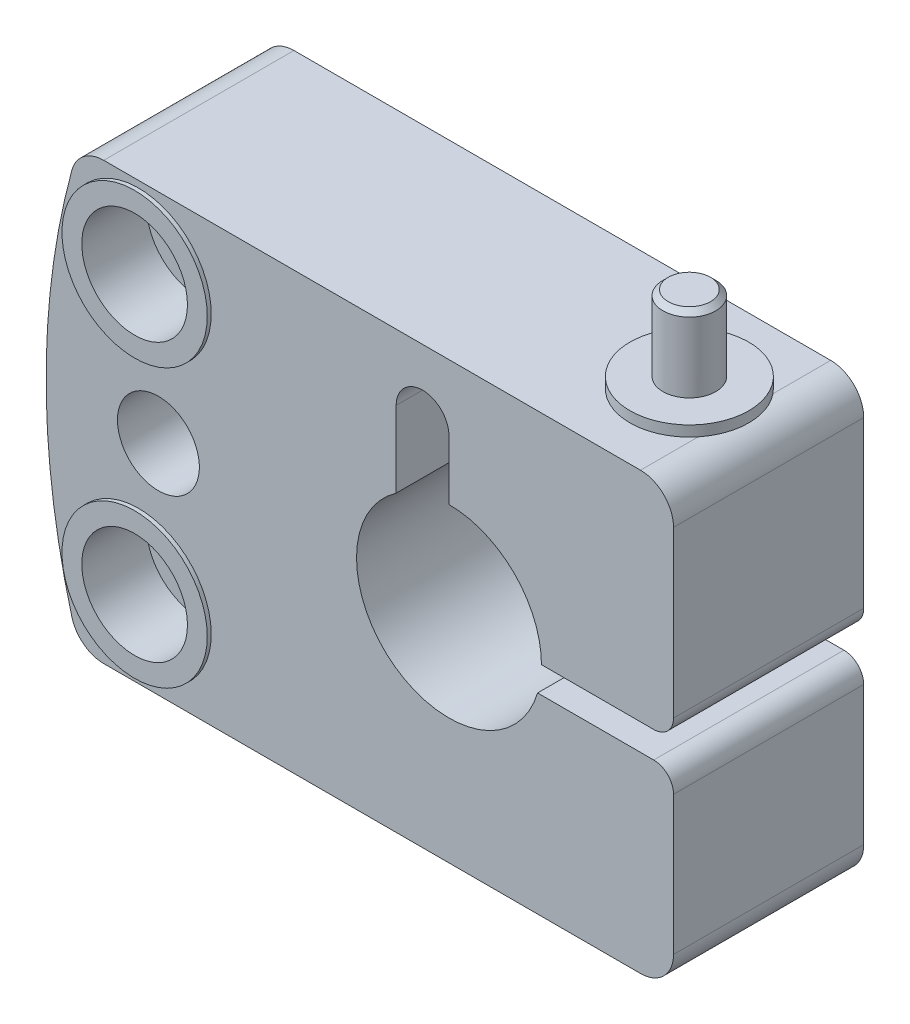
ISO-10303-21;
HEADER;
FILE_DESCRIPTION(('STEP AP214'),'2;1');
FILE_NAME('part.step','',(''),(''),'','','');
FILE_SCHEMA(('AUTOMOTIVE_DESIGN { 1 0 10303 214 1 1 1 1 }'));
ENDSEC;
DATA;
#1=APPLICATION_CONTEXT('core data for automotive mechanical design processes');
#2=APPLICATION_PROTOCOL_DEFINITION('international standard','automotive_design',2000,#1);
#3=PRODUCT_CONTEXT('',#1,'mechanical');
#4=PRODUCT('Part','Part','',(#3));
#5=PRODUCT_RELATED_PRODUCT_CATEGORY('part','',(#4));
#6=PRODUCT_DEFINITION_FORMATION('','',#4);
#7=PRODUCT_DEFINITION_CONTEXT('part definition',#1,'design');
#8=PRODUCT_DEFINITION('design','',#6,#7);
#9=PRODUCT_DEFINITION_SHAPE('','',#8);
#10=(LENGTH_UNIT() NAMED_UNIT(*) SI_UNIT(.MILLI.,.METRE.));
#11=(NAMED_UNIT(*) PLANE_ANGLE_UNIT() SI_UNIT($,.RADIAN.));
#12=(NAMED_UNIT(*) SI_UNIT($,.STERADIAN.) SOLID_ANGLE_UNIT());
#13=UNCERTAINTY_MEASURE_WITH_UNIT(LENGTH_MEASURE(1.E-05),#10,'distance_accuracy_value','');
#14=(GEOMETRIC_REPRESENTATION_CONTEXT(3) GLOBAL_UNCERTAINTY_ASSIGNED_CONTEXT((#13)) GLOBAL_UNIT_ASSIGNED_CONTEXT((#10,
#11,#12)) REPRESENTATION_CONTEXT('',''));
#15=CARTESIAN_POINT('',(0.,0.,0.));
#16=DIRECTION('',(0.,0.,1.));
#17=DIRECTION('',(1.,0.,0.));
#18=AXIS2_PLACEMENT_3D('',#15,#16,#17);
#19=CARTESIAN_POINT('',(-23.5,-10.5,10.1));
#20=DIRECTION('',(0.,0.,-1.));
#21=DIRECTION('',(-1.,0.,0.));
#22=AXIS2_PLACEMENT_3D('',#19,#20,#21);
#23=CYLINDRICAL_SURFACE('',#22,2.25);
#24=CARTESIAN_POINT('',(-23.5,-10.5,4.9));
#25=DIRECTION('',(0.,0.,-1.));
#26=DIRECTION('',(-1.,0.,0.));
#27=AXIS2_PLACEMENT_3D('',#24,#25,#26);
#28=CIRCLE('',#27,2.25);
#29=CARTESIAN_POINT('',(-25.75,-10.5,4.9));
#30=VERTEX_POINT('',#29);
#31=EDGE_CURVE('E334',#30,#30,#28,.F.);
#32=ORIENTED_EDGE('',*,*,#31,.F.);
#33=EDGE_LOOP('',(#32));
#34=FACE_BOUND('',#33,.T.);
#35=CARTESIAN_POINT('',(-23.5,-10.5,10.1));
#36=DIRECTION('',(0.,0.,-1.));
#37=DIRECTION('',(-1.,0.,0.));
#38=AXIS2_PLACEMENT_3D('',#35,#36,#37);
#39=CIRCLE('',#38,2.25);
#40=CARTESIAN_POINT('',(-25.75,-10.5,10.1));
#41=VERTEX_POINT('',#40);
#42=EDGE_CURVE('E339',#41,#41,#39,.T.);
#43=ORIENTED_EDGE('',*,*,#42,.F.);
#44=EDGE_LOOP('',(#43));
#45=FACE_BOUND('',#44,.T.);
#46=ADVANCED_FACE('F16',(#34,#45),#23,.F.);
#47=CARTESIAN_POINT('',(-23.5,10.5,10.1));
#48=DIRECTION('',(0.,0.,-1.));
#49=DIRECTION('',(-1.,0.,0.));
#50=AXIS2_PLACEMENT_3D('',#47,#48,#49);
#51=CYLINDRICAL_SURFACE('',#50,2.25);
#52=CARTESIAN_POINT('',(-23.5,10.5,4.9));
#53=DIRECTION('',(0.,0.,-1.));
#54=DIRECTION('',(-1.,0.,0.));
#55=AXIS2_PLACEMENT_3D('',#52,#53,#54);
#56=CIRCLE('',#55,2.25);
#57=CARTESIAN_POINT('',(-25.75,10.5,4.9));
#58=VERTEX_POINT('',#57);
#59=EDGE_CURVE('E331',#58,#58,#56,.F.);
#60=ORIENTED_EDGE('',*,*,#59,.F.);
#61=EDGE_LOOP('',(#60));
#62=FACE_BOUND('',#61,.T.);
#63=CARTESIAN_POINT('',(-23.5,10.5,10.1));
#64=DIRECTION('',(0.,0.,-1.));
#65=DIRECTION('',(-1.,0.,0.));
#66=AXIS2_PLACEMENT_3D('',#63,#64,#65);
#67=CIRCLE('',#66,2.25);
#68=CARTESIAN_POINT('',(-25.75,10.5,10.1));
#69=VERTEX_POINT('',#68);
#70=EDGE_CURVE('E337',#69,#69,#67,.T.);
#71=ORIENTED_EDGE('',*,*,#70,.F.);
#72=EDGE_LOOP('',(#71));
#73=FACE_BOUND('',#72,.T.);
#74=ADVANCED_FACE('F551',(#62,#73),#51,.F.);
#75=CARTESIAN_POINT('',(-19.452,-14.548,10.1));
#76=DIRECTION('',(0.,0.,1.));
#77=DIRECTION('',(0.,1.,0.));
#78=AXIS2_PLACEMENT_3D('',#75,#76,#77);
#79=PLANE('',#78);
#80=ORIENTED_EDGE('',*,*,#42,.T.);
#81=EDGE_LOOP('',(#80));
#82=FACE_BOUND('',#81,.T.);
#83=CARTESIAN_POINT('',(-23.5,-10.5,10.1));
#84=DIRECTION('',(0.,0.,1.));
#85=DIRECTION('',(1.,0.,0.));
#86=AXIS2_PLACEMENT_3D('',#83,#84,#85);
#87=CIRCLE('',#86,4.);
#88=CARTESIAN_POINT('',(-19.5,-10.5,10.1));
#89=VERTEX_POINT('',#88);
#90=EDGE_CURVE('E328',#89,#89,#87,.F.);
#91=ORIENTED_EDGE('',*,*,#90,.F.);
#92=EDGE_LOOP('',(#91));
#93=FACE_BOUND('',#92,.T.);
#94=ADVANCED_FACE('F554',(#82,#93),#79,.T.);
#95=CARTESIAN_POINT('',(-19.452,6.452,10.1));
#96=DIRECTION('',(0.,0.,1.));
#97=DIRECTION('',(0.,1.,0.));
#98=AXIS2_PLACEMENT_3D('',#95,#96,#97);
#99=PLANE('',#98);
#100=ORIENTED_EDGE('',*,*,#70,.T.);
#101=EDGE_LOOP('',(#100));
#102=FACE_BOUND('',#101,.T.);
#103=CARTESIAN_POINT('',(-23.5,10.5,10.1));
#104=DIRECTION('',(0.,0.,1.));
#105=DIRECTION('',(1.,0.,0.));
#106=AXIS2_PLACEMENT_3D('',#103,#104,#105);
#107=CIRCLE('',#106,4.);
#108=CARTESIAN_POINT('',(-19.5,10.5,10.1));
#109=VERTEX_POINT('',#108);
#110=EDGE_CURVE('E325',#109,#109,#107,.F.);
#111=ORIENTED_EDGE('',*,*,#110,.F.);
#112=EDGE_LOOP('',(#111));
#113=FACE_BOUND('',#112,.T.);
#114=ADVANCED_FACE('F561',(#102,#113),#99,.T.);
#115=CARTESIAN_POINT('',(-19.452,-6.452,4.9));
#116=DIRECTION('',(0.,0.,-1.));
#117=DIRECTION('',(0.,-1.,0.));
#118=AXIS2_PLACEMENT_3D('',#115,#116,#117);
#119=PLANE('',#118);
#120=ORIENTED_EDGE('',*,*,#31,.T.);
#121=EDGE_LOOP('',(#120));
#122=FACE_BOUND('',#121,.T.);
#123=CARTESIAN_POINT('',(-23.5,-10.5,4.9));
#124=DIRECTION('',(0.,0.,-1.));
#125=DIRECTION('',(-1.,0.,0.));
#126=AXIS2_PLACEMENT_3D('',#123,#124,#125);
#127=CIRCLE('',#126,4.);
#128=CARTESIAN_POINT('',(-27.5,-10.5,4.9));
#129=VERTEX_POINT('',#128);
#130=EDGE_CURVE('E322',#129,#129,#127,.F.);
#131=ORIENTED_EDGE('',*,*,#130,.F.);
#132=EDGE_LOOP('',(#131));
#133=FACE_BOUND('',#132,.T.);
#134=ADVANCED_FACE('F564',(#122,#133),#119,.T.);
#135=CARTESIAN_POINT('',(-19.452,14.548,4.9));
#136=DIRECTION('',(0.,0.,-1.));
#137=DIRECTION('',(0.,-1.,0.));
#138=AXIS2_PLACEMENT_3D('',#135,#136,#137);
#139=PLANE('',#138);
#140=ORIENTED_EDGE('',*,*,#59,.T.);
#141=EDGE_LOOP('',(#140));
#142=FACE_BOUND('',#141,.T.);
#143=CARTESIAN_POINT('',(-23.5,10.5,4.9));
#144=DIRECTION('',(0.,0.,-1.));
#145=DIRECTION('',(-1.,0.,0.));
#146=AXIS2_PLACEMENT_3D('',#143,#144,#145);
#147=CIRCLE('',#146,4.);
#148=CARTESIAN_POINT('',(-27.5,10.5,4.9));
#149=VERTEX_POINT('',#148);
#150=EDGE_CURVE('E319',#149,#149,#147,.F.);
#151=ORIENTED_EDGE('',*,*,#150,.F.);
#152=EDGE_LOOP('',(#151));
#153=FACE_BOUND('',#152,.T.);
#154=ADVANCED_FACE('F549',(#142,#153),#139,.T.);
#155=CARTESIAN_POINT('',(-23.5,-10.5,10.1));
#156=DIRECTION('',(0.,0.,1.));
#157=DIRECTION('',(1.,0.,0.));
#158=AXIS2_PLACEMENT_3D('',#155,#156,#157);
#159=CYLINDRICAL_SURFACE('',#158,4.);
#160=CARTESIAN_POINT('',(-23.5,-10.5,15.));
#161=DIRECTION('',(0.,0.,1.));
#162=DIRECTION('',(1.,0.,0.));
#163=AXIS2_PLACEMENT_3D('',#160,#161,#162);
#164=CIRCLE('',#163,4.);
#165=CARTESIAN_POINT('',(-19.5,-10.5,15.));
#166=VERTEX_POINT('',#165);
#167=EDGE_CURVE('E316',#166,#166,#164,.F.);
#168=ORIENTED_EDGE('',*,*,#167,.F.);
#169=EDGE_LOOP('',(#168));
#170=FACE_BOUND('',#169,.T.);
#171=ORIENTED_EDGE('',*,*,#90,.T.);
#172=EDGE_LOOP('',(#171));
#173=FACE_BOUND('',#172,.T.);
#174=ADVANCED_FACE('F545',(#170,#173),#159,.F.);
#175=CARTESIAN_POINT('',(-23.5,10.5,10.1));
#176=DIRECTION('',(0.,0.,1.));
#177=DIRECTION('',(1.,0.,0.));
#178=AXIS2_PLACEMENT_3D('',#175,#176,#177);
#179=CYLINDRICAL_SURFACE('',#178,4.);
#180=CARTESIAN_POINT('',(-23.5,10.5,15.));
#181=DIRECTION('',(0.,0.,1.));
#182=DIRECTION('',(1.,0.,0.));
#183=AXIS2_PLACEMENT_3D('',#180,#181,#182);
#184=CIRCLE('',#183,4.);
#185=CARTESIAN_POINT('',(-19.5,10.5,15.));
#186=VERTEX_POINT('',#185);
#187=EDGE_CURVE('E313',#186,#186,#184,.F.);
#188=ORIENTED_EDGE('',*,*,#187,.F.);
#189=EDGE_LOOP('',(#188));
#190=FACE_BOUND('',#189,.T.);
#191=ORIENTED_EDGE('',*,*,#110,.T.);
#192=EDGE_LOOP('',(#191));
#193=FACE_BOUND('',#192,.T.);
#194=ADVANCED_FACE('F541',(#190,#193),#179,.F.);
#195=CARTESIAN_POINT('',(-23.5,-10.5,4.9));
#196=DIRECTION('',(0.,0.,-1.));
#197=DIRECTION('',(-1.,0.,0.));
#198=AXIS2_PLACEMENT_3D('',#195,#196,#197);
#199=CYLINDRICAL_SURFACE('',#198,4.);
#200=ORIENTED_EDGE('',*,*,#130,.T.);
#201=EDGE_LOOP('',(#200));
#202=FACE_BOUND('',#201,.T.);
#203=CARTESIAN_POINT('',(-23.5,-10.5,0.));
#204=DIRECTION('',(0.,0.,-1.));
#205=DIRECTION('',(-1.,0.,0.));
#206=AXIS2_PLACEMENT_3D('',#203,#204,#205);
#207=CIRCLE('',#206,4.);
#208=CARTESIAN_POINT('',(-27.5,-10.5,0.));
#209=VERTEX_POINT('',#208);
#210=EDGE_CURVE('E310',#209,#209,#207,.T.);
#211=ORIENTED_EDGE('',*,*,#210,.T.);
#212=EDGE_LOOP('',(#211));
#213=FACE_BOUND('',#212,.T.);
#214=ADVANCED_FACE('F537',(#202,#213),#199,.F.);
#215=CARTESIAN_POINT('',(-23.5,10.5,4.9));
#216=DIRECTION('',(0.,0.,-1.));
#217=DIRECTION('',(-1.,0.,0.));
#218=AXIS2_PLACEMENT_3D('',#215,#216,#217);
#219=CYLINDRICAL_SURFACE('',#218,4.);
#220=ORIENTED_EDGE('',*,*,#150,.T.);
#221=EDGE_LOOP('',(#220));
#222=FACE_BOUND('',#221,.T.);
#223=CARTESIAN_POINT('',(-23.5,10.5,0.));
#224=DIRECTION('',(0.,0.,-1.));
#225=DIRECTION('',(-1.,0.,0.));
#226=AXIS2_PLACEMENT_3D('',#223,#224,#225);
#227=CIRCLE('',#226,4.);
#228=CARTESIAN_POINT('',(-27.5,10.5,0.));
#229=VERTEX_POINT('',#228);
#230=EDGE_CURVE('E307',#229,#229,#227,.T.);
#231=ORIENTED_EDGE('',*,*,#230,.T.);
#232=EDGE_LOOP('',(#231));
#233=FACE_BOUND('',#232,.T.);
#234=ADVANCED_FACE('F533',(#222,#233),#219,.F.);
#235=CARTESIAN_POINT('',(-17.934,-16.066,15.));
#236=DIRECTION('',(0.,0.,1.));
#237=DIRECTION('',(0.,1.,0.));
#238=AXIS2_PLACEMENT_3D('',#235,#236,#237);
#239=PLANE('',#238);
#240=ORIENTED_EDGE('',*,*,#167,.T.);
#241=EDGE_LOOP('',(#240));
#242=FACE_BOUND('',#241,.T.);
#243=CARTESIAN_POINT('',(-23.5,-10.5,15.));
#244=DIRECTION('',(0.,0.,1.));
#245=DIRECTION('',(1.,0.,0.));
#246=AXIS2_PLACEMENT_3D('',#243,#244,#245);
#247=CIRCLE('',#246,5.5);
#248=CARTESIAN_POINT('',(-18.,-10.5,15.));
#249=VERTEX_POINT('',#248);
#250=EDGE_CURVE('E304',#249,#249,#247,.T.);
#251=ORIENTED_EDGE('',*,*,#250,.T.);
#252=EDGE_LOOP('',(#251));
#253=FACE_BOUND('',#252,.T.);
#254=ADVANCED_FACE('F536',(#242,#253),#239,.T.);
#255=CARTESIAN_POINT('',(-17.934,4.934,15.));
#256=DIRECTION('',(0.,0.,1.));
#257=DIRECTION('',(0.,1.,0.));
#258=AXIS2_PLACEMENT_3D('',#255,#256,#257);
#259=PLANE('',#258);
#260=ORIENTED_EDGE('',*,*,#187,.T.);
#261=EDGE_LOOP('',(#260));
#262=FACE_BOUND('',#261,.T.);
#263=CARTESIAN_POINT('',(-23.5,10.5,15.));
#264=DIRECTION('',(0.,0.,1.));
#265=DIRECTION('',(1.,0.,0.));
#266=AXIS2_PLACEMENT_3D('',#263,#264,#265);
#267=CIRCLE('',#266,5.5);
#268=CARTESIAN_POINT('',(-18.,10.5,15.));
#269=VERTEX_POINT('',#268);
#270=EDGE_CURVE('E214',#269,#269,#267,.T.);
#271=ORIENTED_EDGE('',*,*,#270,.T.);
#272=EDGE_LOOP('',(#271));
#273=FACE_BOUND('',#272,.T.);
#274=ADVANCED_FACE('F531',(#262,#273),#259,.T.);
#275=CARTESIAN_POINT('',(11.,-2.,7.5));
#276=DIRECTION('',(0.,1.,0.));
#277=DIRECTION('',(0.,0.,1.));
#278=AXIS2_PLACEMENT_3D('',#275,#276,#277);
#279=CYLINDRICAL_SURFACE('',#278,2.);
#280=CARTESIAN_POINT('',(11.,-2.09207651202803E-11,7.5));
#281=DIRECTION('',(0.,1.,0.));
#282=DIRECTION('',(0.,0.,1.));
#283=AXIS2_PLACEMENT_3D('',#280,#281,#282);
#284=CIRCLE('',#283,2.);
#285=CARTESIAN_POINT('',(11.,-2.09207651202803E-11,9.5));
#286=VERTEX_POINT('',#285);
#287=EDGE_CURVE('E187',#286,#286,#284,.F.);
#288=ORIENTED_EDGE('',*,*,#287,.T.);
#289=EDGE_LOOP('',(#288));
#290=FACE_BOUND('',#289,.T.);
#291=CARTESIAN_POINT('',(11.,-1.99999999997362,7.5));
#292=DIRECTION('',(0.,1.,0.));
#293=DIRECTION('',(0.,0.,1.));
#294=AXIS2_PLACEMENT_3D('',#291,#292,#293);
#295=CIRCLE('',#294,2.);
#296=CARTESIAN_POINT('',(11.,-1.99999999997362,9.5));
#297=VERTEX_POINT('',#296);
#298=EDGE_CURVE('E208',#297,#297,#295,.T.);
#299=ORIENTED_EDGE('',*,*,#298,.T.);
#300=EDGE_LOOP('',(#299));
#301=FACE_BOUND('',#300,.T.);
#302=ADVANCED_FACE('F527',(#290,#301),#279,.T.);
#303=CARTESIAN_POINT('',(-17.934,-16.066,0.));
#304=DIRECTION('',(0.,0.,1.));
#305=DIRECTION('',(0.,1.,0.));
#306=AXIS2_PLACEMENT_3D('',#303,#304,#305);
#307=PLANE('',#306);
#308=ORIENTED_EDGE('',*,*,#210,.F.);
#309=EDGE_LOOP('',(#308));
#310=FACE_BOUND('',#309,.T.);
#311=CARTESIAN_POINT('',(-23.5,-10.5,0.));
#312=DIRECTION('',(0.,0.,-1.));
#313=DIRECTION('',(-1.,0.,0.));
#314=AXIS2_PLACEMENT_3D('',#311,#312,#313);
#315=CIRCLE('',#314,5.5);
#316=CARTESIAN_POINT('',(-29.,-10.5,0.));
#317=VERTEX_POINT('',#316);
#318=EDGE_CURVE('E295',#317,#317,#315,.T.);
#319=ORIENTED_EDGE('',*,*,#318,.T.);
#320=EDGE_LOOP('',(#319));
#321=FACE_BOUND('',#320,.T.);
#322=ADVANCED_FACE('F530',(#310,#321),#307,.F.);
#323=CARTESIAN_POINT('',(-17.934,4.934,0.));
#324=DIRECTION('',(0.,0.,1.));
#325=DIRECTION('',(0.,1.,0.));
#326=AXIS2_PLACEMENT_3D('',#323,#324,#325);
#327=PLANE('',#326);
#328=ORIENTED_EDGE('',*,*,#230,.F.);
#329=EDGE_LOOP('',(#328));
#330=FACE_BOUND('',#329,.T.);
#331=CARTESIAN_POINT('',(-23.5,10.5,0.));
#332=DIRECTION('',(0.,0.,-1.));
#333=DIRECTION('',(-1.,0.,0.));
#334=AXIS2_PLACEMENT_3D('',#331,#332,#333);
#335=CIRCLE('',#334,5.5);
#336=CARTESIAN_POINT('',(-29.,10.5,0.));
#337=VERTEX_POINT('',#336);
#338=EDGE_CURVE('E192',#337,#337,#335,.T.);
#339=ORIENTED_EDGE('',*,*,#338,.T.);
#340=EDGE_LOOP('',(#339));
#341=FACE_BOUND('',#340,.T.);
#342=ADVANCED_FACE('F525',(#330,#341),#327,.F.);
#343=CARTESIAN_POINT('',(-23.5,-10.5,14.7));
#344=DIRECTION('',(0.,0.,1.));
#345=DIRECTION('',(1.,0.,0.));
#346=AXIS2_PLACEMENT_3D('',#343,#344,#345);
#347=CYLINDRICAL_SURFACE('',#346,5.5);
#348=ORIENTED_EDGE('',*,*,#250,.F.);
#349=EDGE_LOOP('',(#348));
#350=FACE_BOUND('',#349,.T.);
#351=CARTESIAN_POINT('',(-23.5,-10.5,14.7));
#352=DIRECTION('',(0.,0.,1.));
#353=DIRECTION('',(1.,0.,0.));
#354=AXIS2_PLACEMENT_3D('',#351,#352,#353);
#355=CIRCLE('',#354,5.5);
#356=CARTESIAN_POINT('',(-18.,-10.5,14.7));
#357=VERTEX_POINT('',#356);
#358=EDGE_CURVE('E273',#357,#357,#355,.T.);
#359=ORIENTED_EDGE('',*,*,#358,.T.);
#360=EDGE_LOOP('',(#359));
#361=FACE_BOUND('',#360,.T.);
#362=ADVANCED_FACE('F521',(#350,#361),#347,.T.);
#363=CARTESIAN_POINT('',(-23.5,10.5,14.7));
#364=DIRECTION('',(0.,0.,1.));
#365=DIRECTION('',(1.,0.,0.));
#366=AXIS2_PLACEMENT_3D('',#363,#364,#365);
#367=CYLINDRICAL_SURFACE('',#366,5.5);
#368=ORIENTED_EDGE('',*,*,#270,.F.);
#369=EDGE_LOOP('',(#368));
#370=FACE_BOUND('',#369,.T.);
#371=CARTESIAN_POINT('',(-23.5,10.5,14.7));
#372=DIRECTION('',(0.,0.,1.));
#373=DIRECTION('',(1.,0.,0.));
#374=AXIS2_PLACEMENT_3D('',#371,#372,#373);
#375=CIRCLE('',#374,5.5);
#376=CARTESIAN_POINT('',(-18.,10.5,14.7));
#377=VERTEX_POINT('',#376);
#378=EDGE_CURVE('E270',#377,#377,#375,.T.);
#379=ORIENTED_EDGE('',*,*,#378,.T.);
#380=EDGE_LOOP('',(#379));
#381=FACE_BOUND('',#380,.T.);
#382=ADVANCED_FACE('F518',(#370,#381),#367,.T.);
#383=CARTESIAN_POINT('',(0.,0.,14.7));
#384=DIRECTION('',(0.,0.,-1.));
#385=DIRECTION('',(-1.,0.,0.));
#386=AXIS2_PLACEMENT_3D('',#383,#384,#385);
#387=CYLINDRICAL_SURFACE('',#386,7.);
#388=DIRECTION('',(0.,0.,-1.));
#389=VECTOR('',#388,1.);
#390=CARTESIAN_POINT('',(0.,7.,7.5));
#391=LINE('',#390,#389);
#392=CARTESIAN_POINT('',(-5.08000239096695E-09,7.,14.7));
#393=VERTEX_POINT('',#392);
#394=CARTESIAN_POINT('',(-5.08000239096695E-09,7.,0.3));
#395=VERTEX_POINT('',#394);
#396=EDGE_CURVE('E213',#393,#395,#391,.T.);
#397=ORIENTED_EDGE('',*,*,#396,.T.);
#398=CARTESIAN_POINT('',(0.,0.,0.3));
#399=DIRECTION('',(0.,0.,-1.));
#400=DIRECTION('',(-1.,0.,0.));
#401=AXIS2_PLACEMENT_3D('',#398,#399,#400);
#402=CIRCLE('',#401,7.);
#403=CARTESIAN_POINT('',(7.,0.,0.3));
#404=VERTEX_POINT('',#403);
#405=EDGE_CURVE('E195',#404,#395,#402,.F.);
#406=ORIENTED_EDGE('',*,*,#405,.F.);
#407=DIRECTION('',(0.,0.,1.));
#408=VECTOR('',#407,1.);
#409=CARTESIAN_POINT('',(7.,0.,7.5));
#410=LINE('',#409,#408);
#411=CARTESIAN_POINT('',(7.,0.,14.7));
#412=VERTEX_POINT('',#411);
#413=EDGE_CURVE('E188',#404,#412,#410,.T.);
#414=ORIENTED_EDGE('',*,*,#413,.T.);
#415=CARTESIAN_POINT('',(0.,0.,14.7));
#416=DIRECTION('',(0.,0.,-1.));
#417=DIRECTION('',(-1.,0.,0.));
#418=AXIS2_PLACEMENT_3D('',#415,#416,#417);
#419=CIRCLE('',#418,7.);
#420=EDGE_CURVE('E276',#412,#393,#419,.F.);
#421=ORIENTED_EDGE('',*,*,#420,.T.);
#422=EDGE_LOOP('',(#397,#406,#414,#421));
#423=FACE_BOUND('',#422,.T.);
#424=ADVANCED_FACE('F421',(#423),#387,.F.);
#425=CARTESIAN_POINT('',(0.,7.,14.7));
#426=DIRECTION('',(1.,0.,0.));
#427=DIRECTION('',(0.,0.,-1.));
#428=AXIS2_PLACEMENT_3D('',#425,#426,#427);
#429=PLANE('',#428);
#430=DIRECTION('',(0.,1.,0.));
#431=VECTOR('',#430,1.);
#432=CARTESIAN_POINT('',(-1.0160001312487E-08,0.,14.7));
#433=LINE('',#432,#431);
#434=CARTESIAN_POINT('',(-5.08000239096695E-09,11.5000000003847,14.7));
#435=VERTEX_POINT('',#434);
#436=EDGE_CURVE('E143',#393,#435,#433,.T.);
#437=ORIENTED_EDGE('',*,*,#436,.T.);
#438=DIRECTION('',(0.,0.,-1.));
#439=VECTOR('',#438,1.);
#440=CARTESIAN_POINT('',(0.,11.5000000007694,7.5));
#441=LINE('',#440,#439);
#442=CARTESIAN_POINT('',(-5.08000239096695E-09,11.5000000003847,0.3));
#443=VERTEX_POINT('',#442);
#444=EDGE_CURVE('E154',#443,#435,#441,.F.);
#445=ORIENTED_EDGE('',*,*,#444,.F.);
#446=DIRECTION('',(0.,1.,0.));
#447=VECTOR('',#446,1.);
#448=CARTESIAN_POINT('',(-1.0160001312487E-08,0.,0.3));
#449=LINE('',#448,#447);
#450=EDGE_CURVE('E265',#395,#443,#449,.T.);
#451=ORIENTED_EDGE('',*,*,#450,.F.);
#452=ORIENTED_EDGE('',*,*,#396,.F.);
#453=EDGE_LOOP('',(#437,#445,#451,#452));
#454=FACE_BOUND('',#453,.T.);
#455=ADVANCED_FACE('F418',(#454),#429,.F.);
#456=CARTESIAN_POINT('',(-2.,11.5,14.7));
#457=DIRECTION('',(0.,0.,-1.));
#458=DIRECTION('',(-1.,0.,0.));
#459=AXIS2_PLACEMENT_3D('',#456,#457,#458);
#460=CYLINDRICAL_SURFACE('',#459,2.);
#461=DIRECTION('',(0.,0.,-1.));
#462=VECTOR('',#461,1.);
#463=CARTESIAN_POINT('',(-4.,11.5,7.5));
#464=LINE('',#463,#462);
#465=CARTESIAN_POINT('',(-3.99999998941,11.5,14.7));
#466=VERTEX_POINT('',#465);
#467=CARTESIAN_POINT('',(-3.99999998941,11.5,0.3));
#468=VERTEX_POINT('',#467);
#469=EDGE_CURVE('E152',#466,#468,#464,.T.);
#470=ORIENTED_EDGE('',*,*,#469,.T.);
#471=CARTESIAN_POINT('',(-2.,11.5,0.3));
#472=DIRECTION('',(0.,0.,-1.));
#473=DIRECTION('',(-1.,0.,0.));
#474=AXIS2_PLACEMENT_3D('',#471,#472,#473);
#475=CIRCLE('',#474,2.);
#476=EDGE_CURVE('E263',#443,#468,#475,.F.);
#477=ORIENTED_EDGE('',*,*,#476,.F.);
#478=ORIENTED_EDGE('',*,*,#444,.T.);
#479=CARTESIAN_POINT('',(-2.,11.5,14.7));
#480=DIRECTION('',(0.,0.,-1.));
#481=DIRECTION('',(-1.,0.,0.));
#482=AXIS2_PLACEMENT_3D('',#479,#480,#481);
#483=CIRCLE('',#482,2.);
#484=EDGE_CURVE('E148',#435,#466,#483,.F.);
#485=ORIENTED_EDGE('',*,*,#484,.T.);
#486=EDGE_LOOP('',(#470,#477,#478,#485));
#487=FACE_BOUND('',#486,.T.);
#488=ADVANCED_FACE('F150',(#487),#460,.F.);
#489=CARTESIAN_POINT('',(-4.,5.744562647,0.3));
#490=DIRECTION('',(-1.,0.,0.));
#491=DIRECTION('',(0.,0.,1.));
#492=AXIS2_PLACEMENT_3D('',#489,#490,#491);
#493=PLANE('',#492);
#494=DIRECTION('',(0.,-1.,0.));
#495=VECTOR('',#494,1.);
#496=CARTESIAN_POINT('',(-3.99999997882,0.,14.7));
#497=LINE('',#496,#495);
#498=CARTESIAN_POINT('',(-3.99999998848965,5.7445626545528,14.7));
#499=VERTEX_POINT('',#498);
#500=EDGE_CURVE('E157',#466,#499,#497,.T.);
#501=ORIENTED_EDGE('',*,*,#500,.T.);
#502=DIRECTION('',(0.,0.,-1.));
#503=VECTOR('',#502,1.);
#504=CARTESIAN_POINT('',(-3.99999999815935,5.7445626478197,7.5));
#505=LINE('',#504,#503);
#506=CARTESIAN_POINT('',(-3.99999998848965,5.7445626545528,0.3));
#507=VERTEX_POINT('',#506);
#508=EDGE_CURVE('E167',#507,#499,#505,.F.);
#509=ORIENTED_EDGE('',*,*,#508,.F.);
#510=DIRECTION('',(0.,-1.,0.));
#511=VECTOR('',#510,1.);
#512=CARTESIAN_POINT('',(-3.99999997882,0.,0.3));
#513=LINE('',#512,#511);
#514=EDGE_CURVE('E165',#468,#507,#513,.T.);
#515=ORIENTED_EDGE('',*,*,#514,.F.);
#516=ORIENTED_EDGE('',*,*,#469,.F.);
#517=EDGE_LOOP('',(#501,#509,#515,#516));
#518=FACE_BOUND('',#517,.T.);
#519=ADVANCED_FACE('F161',(#518),#493,.F.);
#520=CARTESIAN_POINT('',(0.,0.,14.7));
#521=DIRECTION('',(0.,0.,-1.));
#522=DIRECTION('',(-1.,0.,0.));
#523=AXIS2_PLACEMENT_3D('',#520,#521,#522);
#524=CYLINDRICAL_SURFACE('',#523,7.);
#525=DIRECTION('',(0.,0.,-1.));
#526=VECTOR('',#525,1.);
#527=CARTESIAN_POINT('',(6.708203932,-2.,7.5));
#528=LINE('',#527,#526);
#529=CARTESIAN_POINT('',(6.70820393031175,-2.0000000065,14.7));
#530=VERTEX_POINT('',#529);
#531=CARTESIAN_POINT('',(6.70820393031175,-2.0000000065,0.3));
#532=VERTEX_POINT('',#531);
#533=EDGE_CURVE('E209',#530,#532,#528,.T.);
#534=ORIENTED_EDGE('',*,*,#533,.T.);
#535=CARTESIAN_POINT('',(0.,0.,0.3));
#536=DIRECTION('',(0.,0.,-1.));
#537=DIRECTION('',(-1.,0.,0.));
#538=AXIS2_PLACEMENT_3D('',#535,#536,#537);
#539=CIRCLE('',#538,7.);
#540=EDGE_CURVE('E260',#507,#532,#539,.F.);
#541=ORIENTED_EDGE('',*,*,#540,.F.);
#542=ORIENTED_EDGE('',*,*,#508,.T.);
#543=CARTESIAN_POINT('',(0.,0.,14.7));
#544=DIRECTION('',(0.,0.,-1.));
#545=DIRECTION('',(-1.,0.,0.));
#546=AXIS2_PLACEMENT_3D('',#543,#544,#545);
#547=CIRCLE('',#546,7.);
#548=EDGE_CURVE('E172',#499,#530,#547,.F.);
#549=ORIENTED_EDGE('',*,*,#548,.T.);
#550=EDGE_LOOP('',(#534,#541,#542,#549));
#551=FACE_BOUND('',#550,.T.);
#552=ADVANCED_FACE('F416',(#551),#524,.F.);
#553=CARTESIAN_POINT('',(6.708203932,-2.,0.3));
#554=DIRECTION('',(0.,-1.,0.));
#555=DIRECTION('',(1.,0.,0.));
#556=AXIS2_PLACEMENT_3D('',#553,#554,#555);
#557=PLANE('',#556);
#558=ORIENTED_EDGE('',*,*,#298,.F.);
#559=EDGE_LOOP('',(#558));
#560=FACE_BOUND('',#559,.T.);
#561=DIRECTION('',(1.,0.,0.));
#562=VECTOR('',#561,1.);
#563=CARTESIAN_POINT('',(-6.8925,-2.000000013,14.7));
#564=LINE('',#563,#562);
#565=CARTESIAN_POINT('',(15.5000000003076,-2.0000000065,14.7));
#566=VERTEX_POINT('',#565);
#567=EDGE_CURVE('E174',#530,#566,#564,.T.);
#568=ORIENTED_EDGE('',*,*,#567,.T.);
#569=DIRECTION('',(0.,0.,1.));
#570=VECTOR('',#569,1.);
#571=CARTESIAN_POINT('',(15.5000000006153,-2.,7.5));
#572=LINE('',#571,#570);
#573=CARTESIAN_POINT('',(15.5000000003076,-2.0000000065,0.3));
#574=VERTEX_POINT('',#573);
#575=EDGE_CURVE('E206',#566,#574,#572,.F.);
#576=ORIENTED_EDGE('',*,*,#575,.T.);
#577=DIRECTION('',(1.,0.,0.));
#578=VECTOR('',#577,1.);
#579=CARTESIAN_POINT('',(-6.8925,-2.000000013,0.3));
#580=LINE('',#579,#578);
#581=EDGE_CURVE('E259',#532,#574,#580,.T.);
#582=ORIENTED_EDGE('',*,*,#581,.F.);
#583=ORIENTED_EDGE('',*,*,#533,.F.);
#584=EDGE_LOOP('',(#568,#576,#582,#583));
#585=FACE_BOUND('',#584,.T.);
#586=ADVANCED_FACE('F414',(#560,#585),#557,.F.);
#587=CARTESIAN_POINT('',(15.5,-3.5,14.7));
#588=DIRECTION('',(0.,0.,-1.));
#589=DIRECTION('',(-1.,0.,0.));
#590=AXIS2_PLACEMENT_3D('',#587,#588,#589);
#591=CYLINDRICAL_SURFACE('',#590,1.5);
#592=CARTESIAN_POINT('',(15.5,-3.5,14.7));
#593=DIRECTION('',(0.,0.,-1.));
#594=DIRECTION('',(-1.,0.,0.));
#595=AXIS2_PLACEMENT_3D('',#592,#593,#594);
#596=CIRCLE('',#595,1.5);
#597=CARTESIAN_POINT('',(17.,-3.5,14.7));
#598=VERTEX_POINT('',#597);
#599=EDGE_CURVE('E291',#566,#598,#596,.T.);
#600=ORIENTED_EDGE('',*,*,#599,.T.);
#601=DIRECTION('',(0.,0.,-1.));
#602=VECTOR('',#601,1.);
#603=CARTESIAN_POINT('',(17.,-3.5,7.5));
#604=LINE('',#603,#602);
#605=CARTESIAN_POINT('',(17.,-3.5,0.3));
#606=VERTEX_POINT('',#605);
#607=EDGE_CURVE('E204',#598,#606,#604,.T.);
#608=ORIENTED_EDGE('',*,*,#607,.T.);
#609=CARTESIAN_POINT('',(15.5,-3.5,0.3));
#610=DIRECTION('',(0.,0.,-1.));
#611=DIRECTION('',(-1.,0.,0.));
#612=AXIS2_PLACEMENT_3D('',#609,#610,#611);
#613=CIRCLE('',#612,1.5);
#614=EDGE_CURVE('E256',#574,#606,#613,.T.);
#615=ORIENTED_EDGE('',*,*,#614,.F.);
#616=ORIENTED_EDGE('',*,*,#575,.F.);
#617=EDGE_LOOP('',(#600,#608,#615,#616));
#618=FACE_BOUND('',#617,.T.);
#619=ADVANCED_FACE('F411',(#618),#591,.T.);
#620=CARTESIAN_POINT('',(17.,-14.,0.3));
#621=DIRECTION('',(-1.,0.,0.));
#622=DIRECTION('',(0.,0.,1.));
#623=AXIS2_PLACEMENT_3D('',#620,#621,#622);
#624=PLANE('',#623);
#625=DIRECTION('',(0.,-1.,0.));
#626=VECTOR('',#625,1.);
#627=CARTESIAN_POINT('',(17.,0.,14.7));
#628=LINE('',#627,#626);
#629=CARTESIAN_POINT('',(17.,-13.9999999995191,14.7));
#630=VERTEX_POINT('',#629);
#631=EDGE_CURVE('E290',#598,#630,#628,.T.);
#632=ORIENTED_EDGE('',*,*,#631,.T.);
#633=DIRECTION('',(0.,0.,1.));
#634=VECTOR('',#633,1.);
#635=CARTESIAN_POINT('',(17.,-13.9999999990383,7.5));
#636=LINE('',#635,#634);
#637=CARTESIAN_POINT('',(17.,-13.9999999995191,0.3));
#638=VERTEX_POINT('',#637);
#639=EDGE_CURVE('E202',#630,#638,#636,.F.);
#640=ORIENTED_EDGE('',*,*,#639,.T.);
#641=DIRECTION('',(0.,-1.,0.));
#642=VECTOR('',#641,1.);
#643=CARTESIAN_POINT('',(17.,0.,0.3));
#644=LINE('',#643,#642);
#645=EDGE_CURVE('E255',#606,#638,#644,.T.);
#646=ORIENTED_EDGE('',*,*,#645,.F.);
#647=ORIENTED_EDGE('',*,*,#607,.F.);
#648=EDGE_LOOP('',(#632,#640,#646,#647));
#649=FACE_BOUND('',#648,.T.);
#650=ADVANCED_FACE('F385',(#649),#624,.F.);
#651=CARTESIAN_POINT('',(14.5,-14.,14.7));
#652=DIRECTION('',(0.,0.,-1.));
#653=DIRECTION('',(-1.,0.,0.));
#654=AXIS2_PLACEMENT_3D('',#651,#652,#653);
#655=CYLINDRICAL_SURFACE('',#654,2.5);
#656=CARTESIAN_POINT('',(14.5,-14.,14.7));
#657=DIRECTION('',(0.,0.,-1.));
#658=DIRECTION('',(-1.,0.,0.));
#659=AXIS2_PLACEMENT_3D('',#656,#657,#658);
#660=CIRCLE('',#659,2.5);
#661=CARTESIAN_POINT('',(14.5,-16.5,14.7));
#662=VERTEX_POINT('',#661);
#663=EDGE_CURVE('E288',#630,#662,#660,.T.);
#664=ORIENTED_EDGE('',*,*,#663,.T.);
#665=DIRECTION('',(0.,0.,-1.));
#666=VECTOR('',#665,1.);
#667=CARTESIAN_POINT('',(14.5,-16.5,7.5));
#668=LINE('',#667,#666);
#669=CARTESIAN_POINT('',(14.5,-16.5,0.3));
#670=VERTEX_POINT('',#669);
#671=EDGE_CURVE('E200',#662,#670,#668,.T.);
#672=ORIENTED_EDGE('',*,*,#671,.T.);
#673=CARTESIAN_POINT('',(14.5,-14.,0.3));
#674=DIRECTION('',(0.,0.,-1.));
#675=DIRECTION('',(-1.,0.,0.));
#676=AXIS2_PLACEMENT_3D('',#673,#674,#675);
#677=CIRCLE('',#676,2.5);
#678=EDGE_CURVE('E252',#638,#670,#677,.T.);
#679=ORIENTED_EDGE('',*,*,#678,.F.);
#680=ORIENTED_EDGE('',*,*,#639,.F.);
#681=EDGE_LOOP('',(#664,#672,#679,#680));
#682=FACE_BOUND('',#681,.T.);
#683=ADVANCED_FACE('F391',(#682),#655,.T.);
#684=CARTESIAN_POINT('',(14.5,-16.5,14.7));
#685=DIRECTION('',(0.,1.,0.));
#686=DIRECTION('',(0.,0.,-1.));
#687=AXIS2_PLACEMENT_3D('',#684,#685,#686);
#688=PLANE('',#687);
#689=DIRECTION('',(-1.,0.,0.));
#690=VECTOR('',#689,1.);
#691=CARTESIAN_POINT('',(-6.8925,-16.5,14.7));
#692=LINE('',#691,#690);
#693=CARTESIAN_POINT('',(-26.135743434,-16.5,14.7));
#694=VERTEX_POINT('',#693);
#695=EDGE_CURVE('E287',#662,#694,#692,.T.);
#696=ORIENTED_EDGE('',*,*,#695,.T.);
#697=DIRECTION('',(0.,0.,1.));
#698=VECTOR('',#697,1.);
#699=CARTESIAN_POINT('',(-26.135743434,-16.5,7.5));
#700=LINE('',#699,#698);
#701=CARTESIAN_POINT('',(-26.135743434,-16.5,0.3));
#702=VERTEX_POINT('',#701);
#703=EDGE_CURVE('E198',#694,#702,#700,.F.);
#704=ORIENTED_EDGE('',*,*,#703,.T.);
#705=DIRECTION('',(-1.,0.,0.));
#706=VECTOR('',#705,1.);
#707=CARTESIAN_POINT('',(-6.8925,-16.5,0.3));
#708=LINE('',#707,#706);
#709=EDGE_CURVE('E251',#670,#702,#708,.T.);
#710=ORIENTED_EDGE('',*,*,#709,.F.);
#711=ORIENTED_EDGE('',*,*,#671,.F.);
#712=EDGE_LOOP('',(#696,#704,#710,#711));
#713=FACE_BOUND('',#712,.T.);
#714=ADVANCED_FACE('F398',(#713),#688,.F.);
#715=CARTESIAN_POINT('',(-26.135743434,-14.,14.7));
#716=DIRECTION('',(0.,0.,-1.));
#717=DIRECTION('',(-1.,0.,0.));
#718=AXIS2_PLACEMENT_3D('',#715,#716,#717);
#719=CYLINDRICAL_SURFACE('',#718,2.5);
#720=CARTESIAN_POINT('',(-26.135743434,-14.,14.7));
#721=DIRECTION('',(0.,0.,-1.));
#722=DIRECTION('',(-1.,0.,0.));
#723=AXIS2_PLACEMENT_3D('',#720,#721,#722);
#724=CIRCLE('',#723,2.5);
#725=CARTESIAN_POINT('',(-28.5486286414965,-14.654205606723,14.7));
#726=VERTEX_POINT('',#725);
#727=EDGE_CURVE('E285',#694,#726,#724,.T.);
#728=ORIENTED_EDGE('',*,*,#727,.T.);
#729=DIRECTION('',(0.,0.,1.));
#730=VECTOR('',#729,1.);
#731=CARTESIAN_POINT('',(-28.5486286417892,-14.6542056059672,7.5));
#732=LINE('',#731,#730);
#733=CARTESIAN_POINT('',(-28.5486286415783,-14.6542056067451,0.3));
#734=VERTEX_POINT('',#733);
#735=EDGE_CURVE('E190',#726,#734,#732,.F.);
#736=ORIENTED_EDGE('',*,*,#735,.T.);
#737=CARTESIAN_POINT('',(-26.135743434,-14.,0.3));
#738=DIRECTION('',(0.,0.,-1.));
#739=DIRECTION('',(-1.,0.,0.));
#740=AXIS2_PLACEMENT_3D('',#737,#738,#739);
#741=CIRCLE('',#740,2.5);
#742=EDGE_CURVE('E248',#702,#734,#741,.T.);
#743=ORIENTED_EDGE('',*,*,#742,.F.);
#744=ORIENTED_EDGE('',*,*,#703,.F.);
#745=EDGE_LOOP('',(#728,#736,#743,#744));
#746=FACE_BOUND('',#745,.T.);
#747=ADVANCED_FACE('F402',(#746),#719,.T.);
#748=CARTESIAN_POINT('',(25.5,0.,14.7));
#749=DIRECTION('',(0.,0.,-1.));
#750=DIRECTION('',(-1.,0.,0.));
#751=AXIS2_PLACEMENT_3D('',#748,#749,#750);
#752=CYLINDRICAL_SURFACE('',#751,56.);
#753=CARTESIAN_POINT('',(25.5,0.,14.7));
#754=DIRECTION('',(0.,0.,-1.));
#755=DIRECTION('',(-1.,0.,0.));
#756=AXIS2_PLACEMENT_3D('',#753,#754,#755);
#757=CIRCLE('',#756,56.);
#758=CARTESIAN_POINT('',(-28.5486286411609,14.654205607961,14.7));
#759=VERTEX_POINT('',#758);
#760=EDGE_CURVE('E283',#726,#759,#757,.T.);
#761=ORIENTED_EDGE('',*,*,#760,.T.);
#762=DIRECTION('',(0.,0.,1.));
#763=VECTOR('',#762,1.);
#764=CARTESIAN_POINT('',(-28.5486286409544,14.654205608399,7.5));
#765=LINE('',#764,#763);
#766=CARTESIAN_POINT('',(-28.5486286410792,14.6542056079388,0.3));
#767=VERTEX_POINT('',#766);
#768=EDGE_CURVE('E193',#759,#767,#765,.F.);
#769=ORIENTED_EDGE('',*,*,#768,.T.);
#770=CARTESIAN_POINT('',(25.5,0.,0.3));
#771=DIRECTION('',(0.,0.,-1.));
#772=DIRECTION('',(-1.,0.,0.));
#773=AXIS2_PLACEMENT_3D('',#770,#771,#772);
#774=CIRCLE('',#773,56.);
#775=EDGE_CURVE('E245',#734,#767,#774,.T.);
#776=ORIENTED_EDGE('',*,*,#775,.F.);
#777=ORIENTED_EDGE('',*,*,#735,.F.);
#778=EDGE_LOOP('',(#761,#769,#776,#777));
#779=FACE_BOUND('',#778,.T.);
#780=ADVANCED_FACE('F453',(#779),#752,.T.);
#781=CARTESIAN_POINT('',(15.5,1.5,14.7));
#782=DIRECTION('',(0.,0.,-1.));
#783=DIRECTION('',(-1.,0.,0.));
#784=AXIS2_PLACEMENT_3D('',#781,#782,#783);
#785=CYLINDRICAL_SURFACE('',#784,1.5);
#786=CARTESIAN_POINT('',(15.5,1.5,14.7));
#787=DIRECTION('',(0.,0.,-1.));
#788=DIRECTION('',(-1.,0.,0.));
#789=AXIS2_PLACEMENT_3D('',#786,#787,#788);
#790=CIRCLE('',#789,1.5);
#791=CARTESIAN_POINT('',(17.,1.5,14.7));
#792=VERTEX_POINT('',#791);
#793=CARTESIAN_POINT('',(15.5,0.,14.7));
#794=VERTEX_POINT('',#793);
#795=EDGE_CURVE('E280',#792,#794,#790,.T.);
#796=ORIENTED_EDGE('',*,*,#795,.T.);
#797=DIRECTION('',(0.,0.,-1.));
#798=VECTOR('',#797,1.);
#799=CARTESIAN_POINT('',(15.5,0.,7.5));
#800=LINE('',#799,#798);
#801=CARTESIAN_POINT('',(15.5,0.,0.3));
#802=VERTEX_POINT('',#801);
#803=EDGE_CURVE('E185',#794,#802,#800,.T.);
#804=ORIENTED_EDGE('',*,*,#803,.T.);
#805=CARTESIAN_POINT('',(15.5,1.5,0.3));
#806=DIRECTION('',(0.,0.,-1.));
#807=DIRECTION('',(-1.,0.,0.));
#808=AXIS2_PLACEMENT_3D('',#805,#806,#807);
#809=CIRCLE('',#808,1.5);
#810=CARTESIAN_POINT('',(17.,1.5,0.3));
#811=VERTEX_POINT('',#810);
#812=EDGE_CURVE('E238',#811,#802,#809,.T.);
#813=ORIENTED_EDGE('',*,*,#812,.F.);
#814=DIRECTION('',(0.,0.,1.));
#815=VECTOR('',#814,1.);
#816=CARTESIAN_POINT('',(17.,1.5,7.5));
#817=LINE('',#816,#815);
#818=EDGE_CURVE('E180',#811,#792,#817,.T.);
#819=ORIENTED_EDGE('',*,*,#818,.T.);
#820=EDGE_LOOP('',(#796,#804,#813,#819));
#821=FACE_BOUND('',#820,.T.);
#822=ADVANCED_FACE('F431',(#821),#785,.T.);
#823=CARTESIAN_POINT('',(15.5,0.,0.3));
#824=DIRECTION('',(0.,1.,0.));
#825=DIRECTION('',(-1.,0.,0.));
#826=AXIS2_PLACEMENT_3D('',#823,#824,#825);
#827=PLANE('',#826);
#828=ORIENTED_EDGE('',*,*,#287,.F.);
#829=EDGE_LOOP('',(#828));
#830=FACE_BOUND('',#829,.T.);
#831=DIRECTION('',(-1.,0.,0.));
#832=VECTOR('',#831,1.);
#833=CARTESIAN_POINT('',(-6.8925,0.,14.7));
#834=LINE('',#833,#832);
#835=EDGE_CURVE('E279',#794,#412,#834,.T.);
#836=ORIENTED_EDGE('',*,*,#835,.T.);
#837=ORIENTED_EDGE('',*,*,#413,.F.);
#838=DIRECTION('',(-1.,0.,0.));
#839=VECTOR('',#838,1.);
#840=CARTESIAN_POINT('',(-6.8925,0.,0.3));
#841=LINE('',#840,#839);
#842=EDGE_CURVE('E237',#802,#404,#841,.T.);
#843=ORIENTED_EDGE('',*,*,#842,.F.);
#844=ORIENTED_EDGE('',*,*,#803,.F.);
#845=EDGE_LOOP('',(#836,#837,#843,#844));
#846=FACE_BOUND('',#845,.T.);
#847=ADVANCED_FACE('F427',(#830,#846),#827,.F.);
#848=CARTESIAN_POINT('',(-23.5,-10.5,0.3));
#849=DIRECTION('',(0.,0.,-1.));
#850=DIRECTION('',(-1.,0.,0.));
#851=AXIS2_PLACEMENT_3D('',#848,#849,#850);
#852=CYLINDRICAL_SURFACE('',#851,5.5);
#853=CARTESIAN_POINT('',(-23.5,-10.5,0.3));
#854=DIRECTION('',(0.,0.,-1.));
#855=DIRECTION('',(-1.,0.,0.));
#856=AXIS2_PLACEMENT_3D('',#853,#854,#855);
#857=CIRCLE('',#856,5.5);
#858=CARTESIAN_POINT('',(-29.,-10.5,0.3));
#859=VERTEX_POINT('',#858);
#860=EDGE_CURVE('E234',#859,#859,#857,.F.);
#861=ORIENTED_EDGE('',*,*,#860,.F.);
#862=EDGE_LOOP('',(#861));
#863=FACE_BOUND('',#862,.T.);
#864=ORIENTED_EDGE('',*,*,#318,.F.);
#865=EDGE_LOOP('',(#864));
#866=FACE_BOUND('',#865,.T.);
#867=ADVANCED_FACE('F497',(#863,#866),#852,.T.);
#868=CARTESIAN_POINT('',(-23.5,10.5,0.3));
#869=DIRECTION('',(0.,0.,-1.));
#870=DIRECTION('',(-1.,0.,0.));
#871=AXIS2_PLACEMENT_3D('',#868,#869,#870);
#872=CYLINDRICAL_SURFACE('',#871,5.5);
#873=CARTESIAN_POINT('',(-23.5,10.5,0.3));
#874=DIRECTION('',(0.,0.,-1.));
#875=DIRECTION('',(-1.,0.,0.));
#876=AXIS2_PLACEMENT_3D('',#873,#874,#875);
#877=CIRCLE('',#876,5.5);
#878=CARTESIAN_POINT('',(-29.,10.5,0.3));
#879=VERTEX_POINT('',#878);
#880=EDGE_CURVE('E231',#879,#879,#877,.F.);
#881=ORIENTED_EDGE('',*,*,#880,.F.);
#882=EDGE_LOOP('',(#881));
#883=FACE_BOUND('',#882,.T.);
#884=ORIENTED_EDGE('',*,*,#338,.F.);
#885=EDGE_LOOP('',(#884));
#886=FACE_BOUND('',#885,.T.);
#887=ADVANCED_FACE('F494',(#883,#886),#872,.T.);
#888=CARTESIAN_POINT('',(17.,1.5,0.3));
#889=DIRECTION('',(-1.,0.,0.));
#890=DIRECTION('',(0.,0.,1.));
#891=AXIS2_PLACEMENT_3D('',#888,#889,#890);
#892=PLANE('',#891);
#893=DIRECTION('',(0.,-1.,0.));
#894=VECTOR('',#893,1.);
#895=CARTESIAN_POINT('',(17.,0.,14.7));
#896=LINE('',#895,#894);
#897=CARTESIAN_POINT('',(17.,14.0000000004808,14.7));
#898=VERTEX_POINT('',#897);
#899=EDGE_CURVE('E282',#898,#792,#896,.T.);
#900=ORIENTED_EDGE('',*,*,#899,.T.);
#901=ORIENTED_EDGE('',*,*,#818,.F.);
#902=DIRECTION('',(0.,-1.,0.));
#903=VECTOR('',#902,1.);
#904=CARTESIAN_POINT('',(17.,0.,0.3));
#905=LINE('',#904,#903);
#906=CARTESIAN_POINT('',(17.,14.0000000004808,0.3));
#907=VERTEX_POINT('',#906);
#908=EDGE_CURVE('E241',#907,#811,#905,.T.);
#909=ORIENTED_EDGE('',*,*,#908,.F.);
#910=DIRECTION('',(0.,0.,-1.));
#911=VECTOR('',#910,1.);
#912=CARTESIAN_POINT('',(17.,14.0000000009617,7.5));
#913=LINE('',#912,#911);
#914=EDGE_CURVE('E181',#907,#898,#913,.F.);
#915=ORIENTED_EDGE('',*,*,#914,.T.);
#916=EDGE_LOOP('',(#900,#901,#909,#915));
#917=FACE_BOUND('',#916,.T.);
#918=ADVANCED_FACE('F433',(#917),#892,.F.);
#919=CARTESIAN_POINT('',(17.,16.5,14.7));
#920=DIRECTION('',(0.,0.,-1.));
#921=DIRECTION('',(0.,-1.,0.));
#922=AXIS2_PLACEMENT_3D('',#919,#920,#921);
#923=PLANE('',#922);
#924=CARTESIAN_POINT('',(-22.,0.,14.7));
#925=DIRECTION('',(0.,0.,-1.));
#926=DIRECTION('',(-1.,0.,0.));
#927=AXIS2_PLACEMENT_3D('',#924,#925,#926);
#928=CIRCLE('',#927,3.1);
#929=CARTESIAN_POINT('',(-25.1,0.,14.7));
#930=VERTEX_POINT('',#929);
#931=EDGE_CURVE('E341',#930,#930,#928,.F.);
#932=ORIENTED_EDGE('',*,*,#931,.F.);
#933=EDGE_LOOP('',(#932));
#934=FACE_BOUND('',#933,.T.);
#935=ORIENTED_EDGE('',*,*,#378,.F.);
#936=EDGE_LOOP('',(#935));
#937=FACE_BOUND('',#936,.T.);
#938=ORIENTED_EDGE('',*,*,#358,.F.);
#939=EDGE_LOOP('',(#938));
#940=FACE_BOUND('',#939,.T.);
#941=ORIENTED_EDGE('',*,*,#835,.F.);
#942=ORIENTED_EDGE('',*,*,#795,.F.);
#943=ORIENTED_EDGE('',*,*,#899,.F.);
#944=CARTESIAN_POINT('',(14.5,14.,14.7));
#945=DIRECTION('',(0.,0.,-1.));
#946=DIRECTION('',(-1.,0.,0.));
#947=AXIS2_PLACEMENT_3D('',#944,#945,#946);
#948=CIRCLE('',#947,2.5);
#949=CARTESIAN_POINT('',(14.5,16.5,14.7));
#950=VERTEX_POINT('',#949);
#951=EDGE_CURVE('E183',#898,#950,#948,.F.);
#952=ORIENTED_EDGE('',*,*,#951,.T.);
#953=DIRECTION('',(-1.,0.,0.));
#954=VECTOR('',#953,1.);
#955=CARTESIAN_POINT('',(-5.817871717,16.5,14.7));
#956=LINE('',#955,#954);
#957=CARTESIAN_POINT('',(-26.135743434,16.5,14.7));
#958=VERTEX_POINT('',#957);
#959=EDGE_CURVE('E358',#950,#958,#956,.T.);
#960=ORIENTED_EDGE('',*,*,#959,.T.);
#961=CARTESIAN_POINT('',(-26.135743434,14.,14.7));
#962=DIRECTION('',(0.,0.,-1.));
#963=DIRECTION('',(-1.,0.,0.));
#964=AXIS2_PLACEMENT_3D('',#961,#962,#963);
#965=CIRCLE('',#964,2.5);
#966=EDGE_CURVE('E196',#958,#759,#965,.F.);
#967=ORIENTED_EDGE('',*,*,#966,.T.);
#968=ORIENTED_EDGE('',*,*,#760,.F.);
#969=ORIENTED_EDGE('',*,*,#727,.F.);
#970=ORIENTED_EDGE('',*,*,#695,.F.);
#971=ORIENTED_EDGE('',*,*,#663,.F.);
#972=ORIENTED_EDGE('',*,*,#631,.F.);
#973=ORIENTED_EDGE('',*,*,#599,.F.);
#974=ORIENTED_EDGE('',*,*,#567,.F.);
#975=ORIENTED_EDGE('',*,*,#548,.F.);
#976=ORIENTED_EDGE('',*,*,#500,.F.);
#977=ORIENTED_EDGE('',*,*,#484,.F.);
#978=ORIENTED_EDGE('',*,*,#436,.F.);
#979=ORIENTED_EDGE('',*,*,#420,.F.);
#980=EDGE_LOOP('',(#941,#942,#943,#952,#960,#967,#968,#969,#970,#971,#972,#973,#974,#975,#976,
#977,#978,#979));
#981=FACE_BOUND('',#980,.T.);
#982=ADVANCED_FACE('F170',(#934,#937,#940,#981),#923,.F.);
#983=CARTESIAN_POINT('',(-26.135743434,14.,14.7));
#984=DIRECTION('',(0.,0.,-1.));
#985=DIRECTION('',(-1.,0.,0.));
#986=AXIS2_PLACEMENT_3D('',#983,#984,#985);
#987=CYLINDRICAL_SURFACE('',#986,2.5);
#988=ORIENTED_EDGE('',*,*,#966,.F.);
#989=DIRECTION('',(0.,0.,-1.));
#990=VECTOR('',#989,1.);
#991=CARTESIAN_POINT('',(-26.135743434,16.5,7.5));
#992=LINE('',#991,#990);
#993=CARTESIAN_POINT('',(-26.135743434,16.5,0.3));
#994=VERTEX_POINT('',#993);
#995=EDGE_CURVE('E361',#958,#994,#992,.T.);
#996=ORIENTED_EDGE('',*,*,#995,.T.);
#997=CARTESIAN_POINT('',(-26.135743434,14.,0.3));
#998=DIRECTION('',(0.,0.,-1.));
#999=DIRECTION('',(-1.,0.,0.));
#1000=AXIS2_PLACEMENT_3D('',#997,#998,#999);
#1001=CIRCLE('',#1000,2.5);
#1002=EDGE_CURVE('E242',#767,#994,#1001,.T.);
#1003=ORIENTED_EDGE('',*,*,#1002,.F.);
#1004=ORIENTED_EDGE('',*,*,#768,.F.);
#1005=EDGE_LOOP('',(#988,#996,#1003,#1004));
#1006=FACE_BOUND('',#1005,.T.);
#1007=ADVANCED_FACE('F450',(#1006),#987,.T.);
#1008=CARTESIAN_POINT('',(17.,16.5,0.3));
#1009=DIRECTION('',(0.,0.,-1.));
#1010=DIRECTION('',(0.,-1.,0.));
#1011=AXIS2_PLACEMENT_3D('',#1008,#1009,#1010);
#1012=PLANE('',#1011);
#1013=CARTESIAN_POINT('',(-22.,0.,0.3));
#1014=DIRECTION('',(0.,0.,-1.));
#1015=DIRECTION('',(-1.,0.,0.));
#1016=AXIS2_PLACEMENT_3D('',#1013,#1014,#1015);
#1017=CIRCLE('',#1016,3.1);
#1018=CARTESIAN_POINT('',(-25.1,0.,0.3));
#1019=VERTEX_POINT('',#1018);
#1020=EDGE_CURVE('E20',#1019,#1019,#1017,.F.);
#1021=ORIENTED_EDGE('',*,*,#1020,.T.);
#1022=EDGE_LOOP('',(#1021));
#1023=FACE_BOUND('',#1022,.T.);
#1024=ORIENTED_EDGE('',*,*,#880,.T.);
#1025=EDGE_LOOP('',(#1024));
#1026=FACE_BOUND('',#1025,.T.);
#1027=ORIENTED_EDGE('',*,*,#860,.T.);
#1028=EDGE_LOOP('',(#1027));
#1029=FACE_BOUND('',#1028,.T.);
#1030=ORIENTED_EDGE('',*,*,#812,.T.);
#1031=ORIENTED_EDGE('',*,*,#842,.T.);
#1032=ORIENTED_EDGE('',*,*,#405,.T.);
#1033=ORIENTED_EDGE('',*,*,#450,.T.);
#1034=ORIENTED_EDGE('',*,*,#476,.T.);
#1035=ORIENTED_EDGE('',*,*,#514,.T.);
#1036=ORIENTED_EDGE('',*,*,#540,.T.);
#1037=ORIENTED_EDGE('',*,*,#581,.T.);
#1038=ORIENTED_EDGE('',*,*,#614,.T.);
#1039=ORIENTED_EDGE('',*,*,#645,.T.);
#1040=ORIENTED_EDGE('',*,*,#678,.T.);
#1041=ORIENTED_EDGE('',*,*,#709,.T.);
#1042=ORIENTED_EDGE('',*,*,#742,.T.);
#1043=ORIENTED_EDGE('',*,*,#775,.T.);
#1044=ORIENTED_EDGE('',*,*,#1002,.T.);
#1045=DIRECTION('',(1.,0.,0.));
#1046=VECTOR('',#1045,1.);
#1047=CARTESIAN_POINT('',(-5.817871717,16.5,0.3));
#1048=LINE('',#1047,#1046);
#1049=CARTESIAN_POINT('',(14.5,16.5,0.3));
#1050=VERTEX_POINT('',#1049);
#1051=EDGE_CURVE('E354',#994,#1050,#1048,.T.);
#1052=ORIENTED_EDGE('',*,*,#1051,.T.);
#1053=CARTESIAN_POINT('',(14.5,14.,0.3));
#1054=DIRECTION('',(0.,0.,-1.));
#1055=DIRECTION('',(-1.,0.,0.));
#1056=AXIS2_PLACEMENT_3D('',#1053,#1054,#1055);
#1057=CIRCLE('',#1056,2.5);
#1058=EDGE_CURVE('E184',#1050,#907,#1057,.T.);
#1059=ORIENTED_EDGE('',*,*,#1058,.T.);
#1060=ORIENTED_EDGE('',*,*,#908,.T.);
#1061=EDGE_LOOP('',(#1030,#1031,#1032,#1033,#1034,#1035,#1036,#1037,#1038,#1039,#1040,#1041,
#1042,#1043,#1044,#1052,#1059,#1060));
#1062=FACE_BOUND('',#1061,.T.);
#1063=ADVANCED_FACE('F406',(#1023,#1026,#1029,#1062),#1012,.T.);
#1064=CARTESIAN_POINT('',(14.5,14.,14.7));
#1065=DIRECTION('',(0.,0.,-1.));
#1066=DIRECTION('',(-1.,0.,0.));
#1067=AXIS2_PLACEMENT_3D('',#1064,#1065,#1066);
#1068=CYLINDRICAL_SURFACE('',#1067,2.5);
#1069=ORIENTED_EDGE('',*,*,#951,.F.);
#1070=ORIENTED_EDGE('',*,*,#914,.F.);
#1071=ORIENTED_EDGE('',*,*,#1058,.F.);
#1072=DIRECTION('',(0.,0.,1.));
#1073=VECTOR('',#1072,1.);
#1074=CARTESIAN_POINT('',(14.5,16.5,7.5));
#1075=LINE('',#1074,#1073);
#1076=CARTESIAN_POINT('',(14.4999999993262,16.5,4.67157287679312));
#1077=VERTEX_POINT('',#1076);
#1078=EDGE_CURVE('E226',#1050,#1077,#1075,.T.);
#1079=ORIENTED_EDGE('',*,*,#1078,.T.);
#1080=DIRECTION('',(0.,0.,1.));
#1081=VECTOR('',#1080,1.);
#1082=CARTESIAN_POINT('',(14.5,16.5,7.5));
#1083=LINE('',#1082,#1081);
#1084=CARTESIAN_POINT('',(14.5,16.5,10.3284271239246));
#1085=VERTEX_POINT('',#1084);
#1086=EDGE_CURVE('E228',#1077,#1085,#1083,.T.);
#1087=ORIENTED_EDGE('',*,*,#1086,.T.);
#1088=DIRECTION('',(0.,0.,1.));
#1089=VECTOR('',#1088,1.);
#1090=CARTESIAN_POINT('',(14.5,16.5,7.5));
#1091=LINE('',#1090,#1089);
#1092=EDGE_CURVE('E355',#1085,#950,#1091,.T.);
#1093=ORIENTED_EDGE('',*,*,#1092,.T.);
#1094=EDGE_LOOP('',(#1069,#1070,#1071,#1079,#1087,#1093));
#1095=FACE_BOUND('',#1094,.T.);
#1096=ADVANCED_FACE('F437',(#1095),#1068,.T.);
#1097=CARTESIAN_POINT('',(15.506,16.5,10.36236825));
#1098=DIRECTION('',(0.,1.,0.));
#1099=DIRECTION('',(0.,0.,-1.));
#1100=AXIS2_PLACEMENT_3D('',#1097,#1098,#1099);
#1101=PLANE('',#1100);
#1102=ORIENTED_EDGE('',*,*,#1086,.F.);
#1103=CARTESIAN_POINT('',(11.,16.5,7.5));
#1104=DIRECTION('',(0.,-1.,0.));
#1105=DIRECTION('',(1.,0.,0.));
#1106=AXIS2_PLACEMENT_3D('',#1103,#1104,#1105);
#1107=CIRCLE('',#1106,4.5);
#1108=EDGE_CURVE('E223',#1077,#1085,#1107,.T.);
#1109=ORIENTED_EDGE('',*,*,#1108,.T.);
#1110=EDGE_LOOP('',(#1102,#1109));
#1111=FACE_BOUND('',#1110,.T.);
#1112=ADVANCED_FACE('F455',(#1111),#1101,.F.);
#1113=CARTESIAN_POINT('',(14.5,16.5,0.3));
#1114=DIRECTION('',(0.,-1.,0.));
#1115=DIRECTION('',(0.,0.,1.));
#1116=AXIS2_PLACEMENT_3D('',#1113,#1114,#1115);
#1117=PLANE('',#1116);
#1118=ORIENTED_EDGE('',*,*,#1078,.F.);
#1119=ORIENTED_EDGE('',*,*,#1051,.F.);
#1120=ORIENTED_EDGE('',*,*,#995,.F.);
#1121=ORIENTED_EDGE('',*,*,#959,.F.);
#1122=ORIENTED_EDGE('',*,*,#1092,.F.);
#1123=CARTESIAN_POINT('',(11.,16.5,7.5));
#1124=DIRECTION('',(0.,-1.,0.));
#1125=DIRECTION('',(1.,0.,0.));
#1126=AXIS2_PLACEMENT_3D('',#1123,#1124,#1125);
#1127=CIRCLE('',#1126,4.5);
#1128=EDGE_CURVE('E34',#1085,#1077,#1127,.T.);
#1129=ORIENTED_EDGE('',*,*,#1128,.T.);
#1130=EDGE_LOOP('',(#1118,#1119,#1120,#1121,#1122,#1129));
#1131=FACE_BOUND('',#1130,.T.);
#1132=ADVANCED_FACE('F445',(#1131),#1117,.F.);
#1133=CARTESIAN_POINT('',(11.,17.3,7.5));
#1134=DIRECTION('',(0.,-1.,0.));
#1135=DIRECTION('',(1.,0.,0.));
#1136=AXIS2_PLACEMENT_3D('',#1133,#1134,#1135);
#1137=CYLINDRICAL_SURFACE('',#1136,4.5);
#1138=ORIENTED_EDGE('',*,*,#1128,.F.);
#1139=ORIENTED_EDGE('',*,*,#1108,.F.);
#1140=EDGE_LOOP('',(#1138,#1139));
#1141=FACE_BOUND('',#1140,.T.);
#1142=CARTESIAN_POINT('',(11.,17.3,7.5));
#1143=DIRECTION('',(0.,-1.,0.));
#1144=DIRECTION('',(1.,0.,0.));
#1145=AXIS2_PLACEMENT_3D('',#1142,#1143,#1144);
#1146=CIRCLE('',#1145,4.5);
#1147=CARTESIAN_POINT('',(15.5,17.3,7.5));
#1148=VERTEX_POINT('',#1147);
#1149=EDGE_CURVE('E219',#1148,#1148,#1146,.F.);
#1150=ORIENTED_EDGE('',*,*,#1149,.F.);
#1151=EDGE_LOOP('',(#1150));
#1152=FACE_BOUND('',#1151,.T.);
#1153=ADVANCED_FACE('F456',(#1141,#1152),#1137,.T.);
#1154=CARTESIAN_POINT('',(15.554,17.3,12.054));
#1155=DIRECTION('',(0.,1.,0.));
#1156=DIRECTION('',(0.,0.,-1.));
#1157=AXIS2_PLACEMENT_3D('',#1154,#1155,#1156);
#1158=PLANE('',#1157);
#1159=CARTESIAN_POINT('',(11.,17.3000000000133,7.5));
#1160=DIRECTION('',(0.,1.,0.));
#1161=DIRECTION('',(-1.,0.,0.));
#1162=AXIS2_PLACEMENT_3D('',#1159,#1160,#1161);
#1163=CIRCLE('',#1162,2.);
#1164=CARTESIAN_POINT('',(9.,17.3000000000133,7.5));
#1165=VERTEX_POINT('',#1164);
#1166=EDGE_CURVE('E216',#1165,#1165,#1163,.F.);
#1167=ORIENTED_EDGE('',*,*,#1166,.T.);
#1168=EDGE_LOOP('',(#1167));
#1169=FACE_BOUND('',#1168,.T.);
#1170=ORIENTED_EDGE('',*,*,#1149,.T.);
#1171=EDGE_LOOP('',(#1170));
#1172=FACE_BOUND('',#1171,.T.);
#1173=ADVANCED_FACE('F459',(#1169,#1172),#1158,.T.);
#1174=CARTESIAN_POINT('',(11.,17.3,7.5));
#1175=DIRECTION('',(0.,1.,0.));
#1176=DIRECTION('',(-1.,0.,0.));
#1177=AXIS2_PLACEMENT_3D('',#1174,#1175,#1176);
#1178=CYLINDRICAL_SURFACE('',#1177,2.);
#1179=CARTESIAN_POINT('',(11.,22.6,7.5));
#1180=DIRECTION('',(0.,-1.,0.));
#1181=DIRECTION('',(0.,0.,1.));
#1182=AXIS2_PLACEMENT_3D('',#1179,#1180,#1181);
#1183=CIRCLE('',#1182,2.);
#1184=CARTESIAN_POINT('',(11.,22.6000000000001,9.5));
#1185=VERTEX_POINT('',#1184);
#1186=EDGE_CURVE('E26',#1185,#1185,#1183,.T.);
#1187=ORIENTED_EDGE('',*,*,#1186,.T.);
#1188=EDGE_LOOP('',(#1187));
#1189=FACE_BOUND('',#1188,.T.);
#1190=ORIENTED_EDGE('',*,*,#1166,.F.);
#1191=EDGE_LOOP('',(#1190));
#1192=FACE_BOUND('',#1191,.T.);
#1193=ADVANCED_FACE('F464',(#1189,#1192),#1178,.T.);
#1194=CARTESIAN_POINT('',(12.6192,23.,9.1192));
#1195=DIRECTION('',(0.,1.,0.));
#1196=DIRECTION('',(0.,0.,-1.));
#1197=AXIS2_PLACEMENT_3D('',#1194,#1195,#1196);
#1198=PLANE('',#1197);
#1199=CARTESIAN_POINT('',(11.,23.,7.5));
#1200=DIRECTION('',(0.,-1.,0.));
#1201=DIRECTION('',(0.,0.,-1.));
#1202=AXIS2_PLACEMENT_3D('',#1199,#1200,#1201);
#1203=CIRCLE('',#1202,1.59999999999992);
#1204=CARTESIAN_POINT('',(11.,23.,5.90000000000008));
#1205=VERTEX_POINT('',#1204);
#1206=EDGE_CURVE('E11',#1205,#1205,#1203,.F.);
#1207=ORIENTED_EDGE('',*,*,#1206,.T.);
#1208=EDGE_LOOP('',(#1207));
#1209=FACE_BOUND('',#1208,.T.);
#1210=ADVANCED_FACE('F18',(#1209),#1198,.T.);
#1211=CARTESIAN_POINT('',(11.,23.,7.5));
#1212=DIRECTION('',(0.,-1.,0.));
#1213=DIRECTION('',(0.,0.,-1.));
#1214=AXIS2_PLACEMENT_3D('',#1211,#1212,#1213);
#1215=CONICAL_SURFACE('',#1214,1.6,0.78539816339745);
#1216=ORIENTED_EDGE('',*,*,#1206,.F.);
#1217=EDGE_LOOP('',(#1216));
#1218=FACE_BOUND('',#1217,.T.);
#1219=ORIENTED_EDGE('',*,*,#1186,.F.);
#1220=EDGE_LOOP('',(#1219));
#1221=FACE_BOUND('',#1220,.T.);
#1222=ADVANCED_FACE('F474',(#1218,#1221),#1215,.T.);
#1223=CARTESIAN_POINT('',(-22.,0.,15.));
#1224=DIRECTION('',(0.,0.,-1.));
#1225=DIRECTION('',(-1.,0.,0.));
#1226=AXIS2_PLACEMENT_3D('',#1223,#1224,#1225);
#1227=CYLINDRICAL_SURFACE('',#1226,3.1);
#1228=ORIENTED_EDGE('',*,*,#1020,.F.);
#1229=EDGE_LOOP('',(#1228));
#1230=FACE_BOUND('',#1229,.T.);
#1231=ORIENTED_EDGE('',*,*,#931,.T.);
#1232=EDGE_LOOP('',(#1231));
#1233=FACE_BOUND('',#1232,.T.);
#1234=ADVANCED_FACE('F476',(#1230,#1233),#1227,.F.);
#1235=CLOSED_SHELL('',(#46,#74,#94,#114,#134,#154,#174,#194,#214,#234,#254,#274,#302,#322,#342,
#362,#382,#424,#455,#488,#519,#552,#586,#619,#650,#683,#714,#747,#780,#822,#847,#867,#887,#918,
#982,#1007,#1063,#1096,#1112,#1132,#1153,#1173,#1193,#1210,#1222,#1234));
#1236=MANIFOLD_SOLID_BREP('B1',#1235);
#1237=ADVANCED_BREP_SHAPE_REPRESENTATION('',(#18,#1236),#14);
#1238=SHAPE_DEFINITION_REPRESENTATION(#9,#1237);
ENDSEC;
END-ISO-10303-21;
